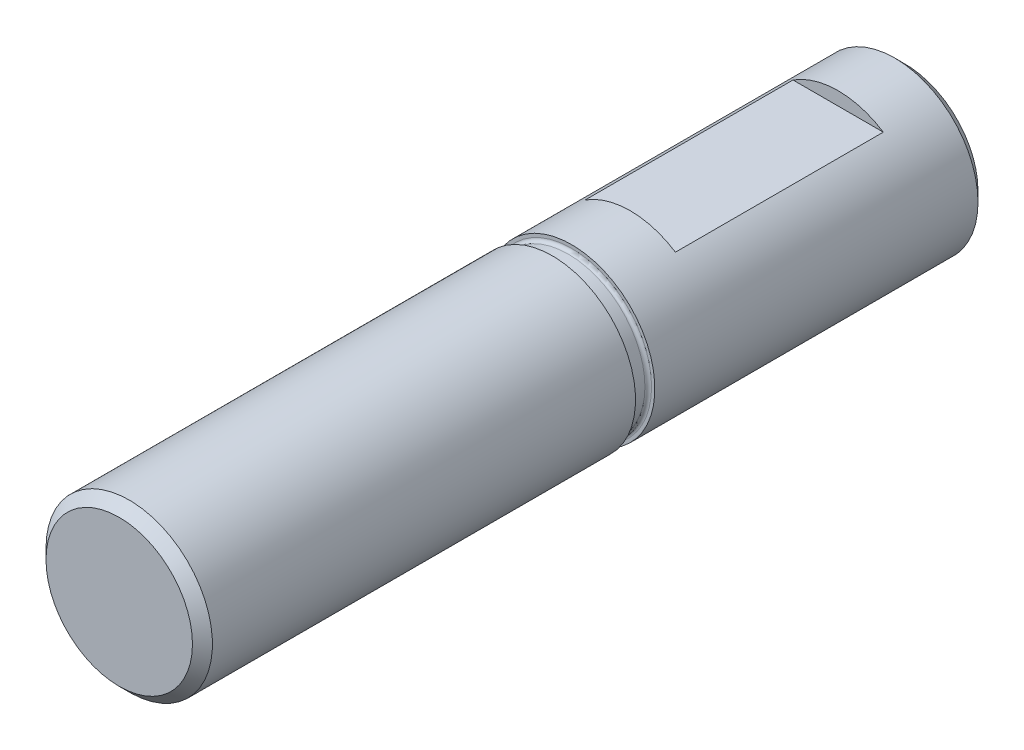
from build123d import *

# Parameters (mm, degrees)
SKETCH1_R          = 3.17246
BASE_EXTRUDE_DEPTH = 29.9466
SKETCH2_W          = 0.25146
SKETCH2_H          = 0.7366
FILLET1_R          = 0.127
SKETCH3_W          = 7.9248
SKETCH3_H          = 1.27
CUT_EXTRUDE1_DEPTH = 2.54
CHAMFER1_SIZE      = 0.381


with BuildPart() as part:
    # Sketch1 → Base-Extrude (new body)
    with BuildSketch(Plane.XY):
        with Locations(Location((0, 0, 0), (0, 0, 180))):
            Circle(SKETCH1_R)
    extrude(amount=BASE_EXTRUDE_DEPTH)

    # Sketch2 → Cut-Revolve1 (revolve, cut)
    with BuildSketch(Plane(origin=(0, 0, 0), x_dir=(1, 0, 0), z_dir=(0, 1, 0)), mode=Mode.PRIVATE) as cut_revolve1_sk:
        with Locations((3.04673, -13.0683)):
            Rectangle(SKETCH2_W, SKETCH2_H)
    revolve(cut_revolve1_sk.sketch.rotate(Axis((0, 0, 0), (0, 0, 1)), 180), axis=Axis((0, 0, 0), (0, 0, 1)), mode=Mode.SUBTRACT)

    # Fillet1
    fillet1_edges = [part.edges().sort_by_distance(p)[0] for p in [
        (2.921, 0, 13.4366),
        (2.921, 0, 12.7),
    ]]
    fillet(fillet1_edges, radius=FILLET1_R)

    # Sketch3 → Cut-Extrude1 (cut, symmetric)
    with BuildSketch(Plane(origin=(0, 0, 0), x_dir=(0, 0, -1), z_dir=(1, 0, 0))):
        with Locations((-6.5024, 3.29946)):
            Rectangle(SKETCH3_W, SKETCH3_H)
    extrude(amount=CUT_EXTRUDE1_DEPTH, both=True, mode=Mode.SUBTRACT)

    # Chamfer1
    chamfer1_edges = [part.edges().sort_by_distance(p)[0] for p in [
        (3.17246, 0, 0),
        (3.17246, 0, 29.9466),
    ]]
    chamfer(chamfer1_edges, length=CHAMFER1_SIZE)


solid = part.part
